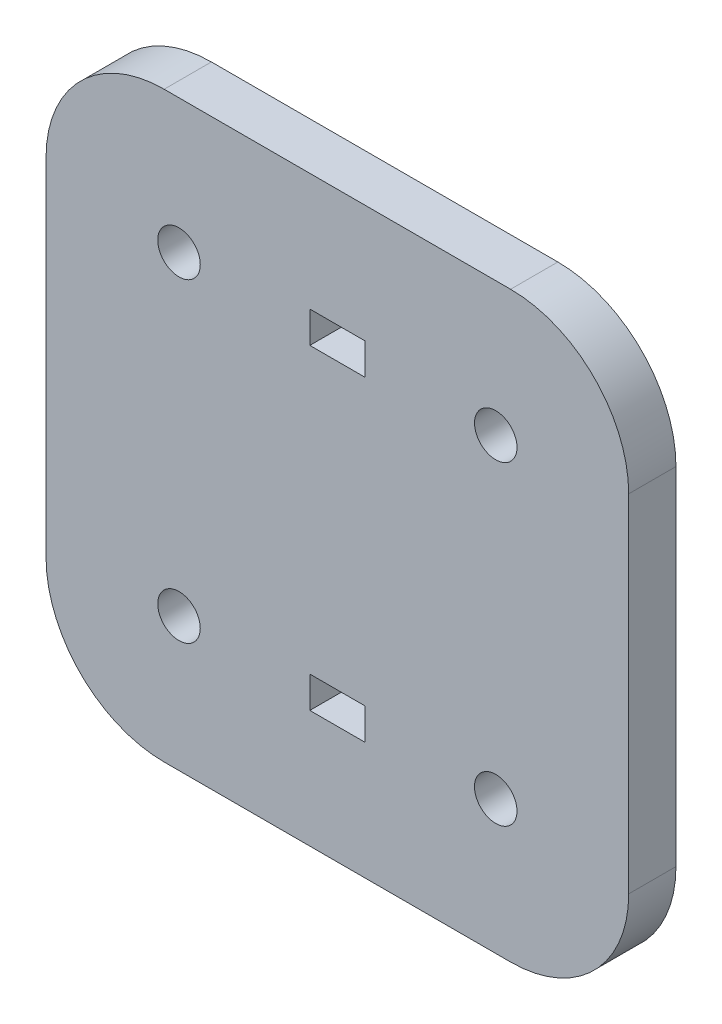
from build123d import *

# Parameters (mm, degrees)
SKETCH3_R           = 2.7
BOSS_EXTRUDE2_DEPTH = 6


with BuildPart() as part:
    # Sketch3 → Boss-Extrude2 (new body)
    with BuildSketch(Plane.XY):
        with BuildLine():
            Line((-47, -93.404160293), (-47, -115.404160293))
            ThreePointArc((-47, -115.404160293), (-42.606601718, -126.01076201), (-32, -130.404160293))
            Line((-32, -130.404160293), (12, -130.404160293))
            ThreePointArc((12, -130.404160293), (22.606601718, -126.01076201), (27, -115.404160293))
            Line((27, -115.404160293), (27, -71.404160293))
            ThreePointArc((27, -71.404160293), (22.606601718, -60.797558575), (12, -56.404160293))
            Line((12, -56.404160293), (-32, -56.404160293))
            ThreePointArc((-32, -56.404160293), (-42.606601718, -60.797558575), (-47, -71.404160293))
            Line((-47, -71.404160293), (-47, -93.404160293))
        make_face()
        with Locations((-30.113345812, -73.404160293)):
            Circle(SKETCH3_R, mode=Mode.SUBTRACT)
        with Locations((10.113345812, -73.404160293)):
            Circle(SKETCH3_R, mode=Mode.SUBTRACT)
        with Locations((10.113345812, -113.404160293)):
            Circle(SKETCH3_R, mode=Mode.SUBTRACT)
        with Locations((-30.113345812, -113.404160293)):
            Circle(SKETCH3_R, mode=Mode.SUBTRACT)
        Polygon((-10, -75.330706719), (-13.5, -75.330706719), (-13.5, -71.330706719), (-6.5, -71.330706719), (-6.5, -75.330706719), align=None, mode=Mode.SUBTRACT)
        Polygon((-6.5, -115.477613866), (-6.5, -111.477613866), (-10, -111.477613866), (-13.5, -111.477613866), (-13.5, -115.477613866), align=None, mode=Mode.SUBTRACT)
    extrude(amount=BOSS_EXTRUDE2_DEPTH)


solid = part.part
